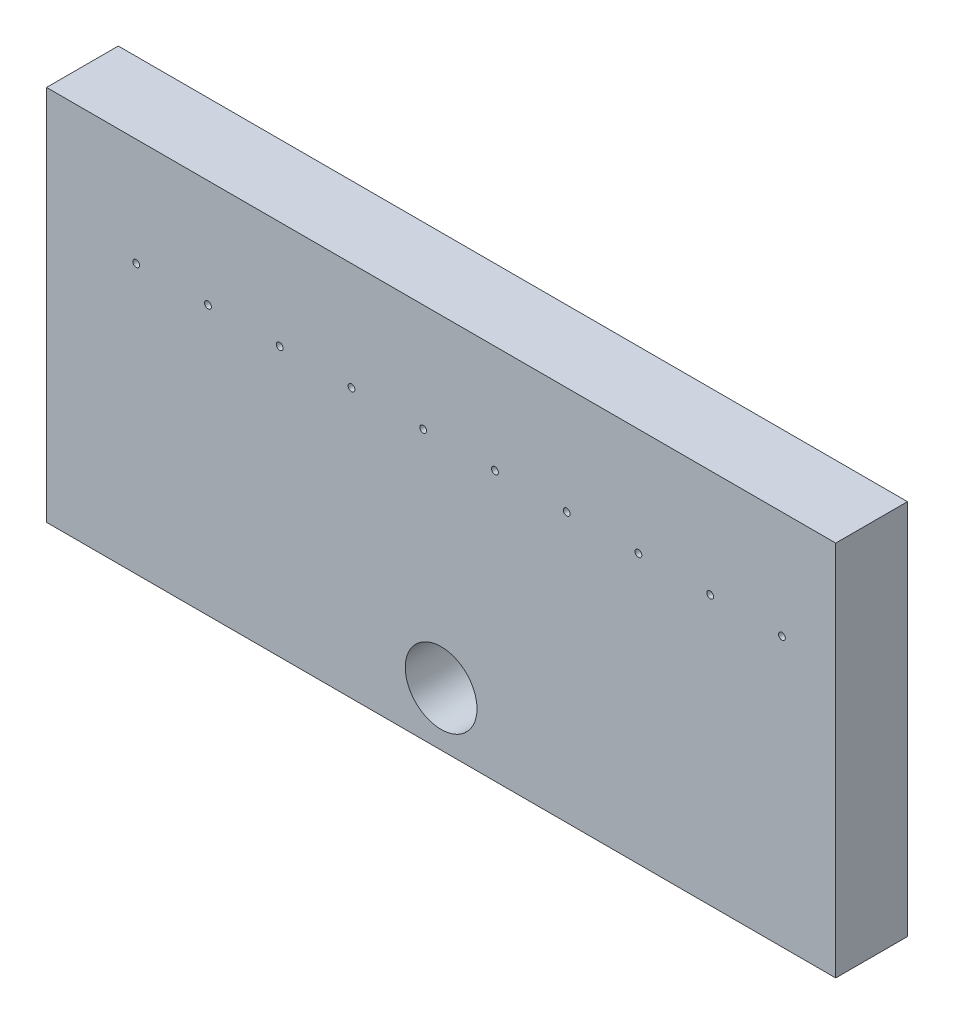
from build123d import *

# Parameters (mm, degrees)
SKETCH1_W           = 1117.6
SKETCH1_H           = 533.4
BOSS_EXTRUDE1_DEPTH = 101.6
SKETCH2_R           = 4.826
CUT_EXTRUDE1_DEPTH  = 50.8
LPATTERN1_COUNT     = 10
LPATTERN1_PITCH     = 101.6
SKETCH3_R           = 50.8
CUT_EXTRUDE2_DEPTH  = 1243.524800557


with BuildPart() as part:
    # Sketch1 → Boss-Extrude1 (new body)
    with BuildSketch(Plane.XY):
        with Locations((558.8, 266.7)):
            Rectangle(SKETCH1_W, SKETCH1_H)
    extrude(amount=BOSS_EXTRUDE1_DEPTH)

    # Sketch2 → Cut-Extrude1 (cut)
    with BuildSketch(Plane.XY.offset(101.6)):
        with Locations((127, 381)):
            Circle(SKETCH2_R)
    cut_extrude1 = extrude(amount=-CUT_EXTRUDE1_DEPTH, mode=Mode.SUBTRACT)

    # LPattern1: Cut-Extrude1 ×10
    with Locations(*[(i * LPATTERN1_PITCH, 0, 0) for i in range(1, LPATTERN1_COUNT)]):
        add(cut_extrude1, mode=Mode.SUBTRACT)

    # Sketch3 → Cut-Extrude2 (cut, through all)
    with BuildSketch(Plane.XY.offset(101.6)):
        with Locations((558.8, 76.2)):
            Circle(SKETCH3_R)
    extrude(amount=-CUT_EXTRUDE2_DEPTH, mode=Mode.SUBTRACT)


solid = part.part
